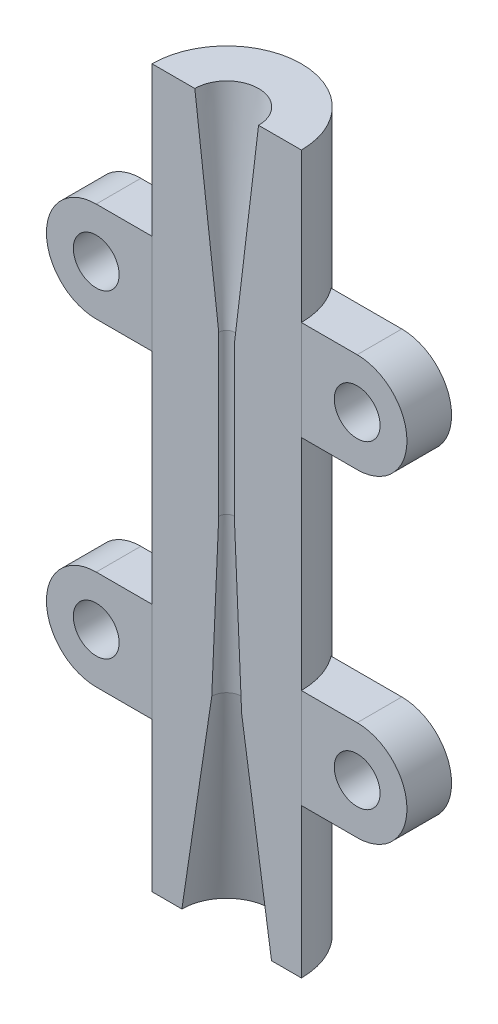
from build123d import *

# Parameters (mm, degrees)
REVOLVE1_ANGLE      = 180
SKETCH2_R           = 2.5
SKETCH2_R_2         = 1.15
SKETCH2_W           = 1.5
SKETCH2_H           = 5
BOSS_EXTRUDE1_DEPTH = 2.24


with BuildPart() as part:
    # Sketch1 → Revolve1 (revolve)
    with BuildSketch(Plane.XY):
        Polygon((-3.35, 18), (-1.2, 18), (0, 8), (0, 0), (-0.35, -8), (-1.85, -18), (-3.35, -18), align=None)
    revolve(axis=Axis((0.4, 18, 0), (0, -1, 0)), revolution_arc=REVOLVE1_ANGLE)


with BuildPart() as body_2:
    # Sketch2 → Boss-Extrude1 (new body)
    # profile 1 of 12: a face of its own
    with BuildSketch(Plane.XY):
        with BuildLine():
            Line((-3.35, 10.5), (-6.150266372, 10.5))
            ThreePointArc((-6.150266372, 10.5), (-4.382499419, 9.767766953), (-3.650266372, 8))
            ThreePointArc((-3.650266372, 8), (-4.382499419, 6.232233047), (-6.150266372, 5.5))
            Line((-6.150266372, 5.5), (-3.35, 5.5))
            Line((-3.35, 5.5), (-3.35, 10.5))
        make_face()
    # profile 2 of 12: a face of its own
    with BuildSketch(Plane.XY):
        with Locations((-6.150266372, 8)):
            Circle(SKETCH2_R)
        with Locations((-6.150266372, 8)):
            Circle(SKETCH2_R_2, mode=Mode.SUBTRACT)
    # profile 3 of 12: a face of its own
    with BuildSketch(Plane.XY):
        with Locations((-2.6, 8)):
            Rectangle(SKETCH2_W, SKETCH2_H)
    # profile 4 of 12: a face of its own
    with BuildSketch(Plane.XY):
        with Locations((6.95, 8)):
            Circle(SKETCH2_R)
        with Locations((6.95, 8)):
            Circle(SKETCH2_R_2, mode=Mode.SUBTRACT)
    # profile 5 of 12: a face of its own
    with BuildSketch(Plane.XY):
        with BuildLine():
            ThreePointArc((6.95, 5.5), (4.45, 8), (6.95, 10.5))
            Line((6.95, 10.5), (4.15, 10.5))
            Line((4.15, 10.5), (4.15, 5.5))
            Line((4.15, 5.5), (6.95, 5.5))
        make_face()
    # profile 6 of 12: a face of its own
    with BuildSketch(Plane.XY):
        with Locations((3.4, 8)):
            Rectangle(SKETCH2_W, SKETCH2_H)
    # profile 7 of 12: a face of its own
    with BuildSketch(Plane.XY):
        with BuildLine():
            ThreePointArc((6.95, -10.5), (4.45, -8), (6.95, -5.5))
            Line((6.95, -5.5), (4.15, -5.5))
            Line((4.15, -5.5), (4.15, -10.5))
            Line((4.15, -10.5), (6.95, -10.5))
        make_face()
    # profile 8 of 12: a face of its own
    with BuildSketch(Plane.XY):
        with Locations((3.4, -8)):
            Rectangle(SKETCH2_W, SKETCH2_H)
    # profile 9 of 12: a face of its own
    with BuildSketch(Plane.XY):
        with Locations((6.95, -8)):
            Circle(SKETCH2_R)
        with Locations((6.95, -8)):
            Circle(SKETCH2_R_2, mode=Mode.SUBTRACT)
    # profile 10 of 12: a face of its own
    with BuildSketch(Plane.XY):
        with Locations((-2.6, -8)):
            Rectangle(SKETCH2_W, SKETCH2_H)
    # profile 11 of 12: a face of its own
    with BuildSketch(Plane.XY):
        with BuildLine():
            Line((-3.35, -10.5), (-3.35, -5.5))
            Line((-3.35, -5.5), (-6.150266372, -5.5))
            ThreePointArc((-6.150266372, -5.5), (-4.382499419, -6.232233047), (-3.650266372, -8))
            ThreePointArc((-3.650266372, -8), (-4.382499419, -9.767766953), (-6.150266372, -10.5))
            Line((-6.150266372, -10.5), (-3.35, -10.5))
        make_face()
    # profile 12 of 12: a face of its own
    with BuildSketch(Plane.XY):
        with Locations((-6.150266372, -8)):
            Circle(SKETCH2_R)
        with Locations((-6.150266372, -8)):
            Circle(SKETCH2_R_2, mode=Mode.SUBTRACT)
    extrude(amount=-BOSS_EXTRUDE1_DEPTH)


solid = Compound([part.part, body_2.part])
